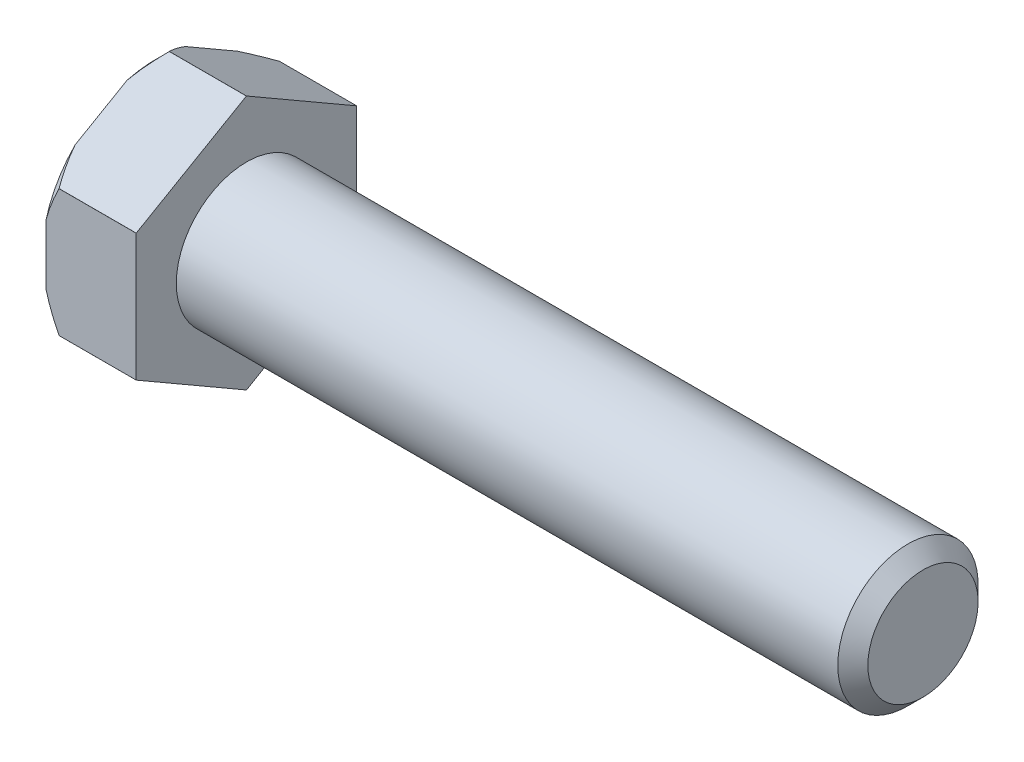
ISO-10303-21;
HEADER;
FILE_DESCRIPTION(('STEP AP214'),'2;1');
FILE_NAME('part.step','',(''),(''),'','','');
FILE_SCHEMA(('AUTOMOTIVE_DESIGN { 1 0 10303 214 1 1 1 1 }'));
ENDSEC;
DATA;
#1=APPLICATION_CONTEXT('core data for automotive mechanical design processes');
#2=APPLICATION_PROTOCOL_DEFINITION('international standard','automotive_design',2000,#1);
#3=PRODUCT_CONTEXT('',#1,'mechanical');
#4=PRODUCT('Part','Part','',(#3));
#5=PRODUCT_RELATED_PRODUCT_CATEGORY('part','',(#4));
#6=PRODUCT_DEFINITION_FORMATION('','',#4);
#7=PRODUCT_DEFINITION_CONTEXT('part definition',#1,'design');
#8=PRODUCT_DEFINITION('design','',#6,#7);
#9=PRODUCT_DEFINITION_SHAPE('','',#8);
#10=(LENGTH_UNIT() NAMED_UNIT(*) SI_UNIT(.MILLI.,.METRE.));
#11=(NAMED_UNIT(*) PLANE_ANGLE_UNIT() SI_UNIT($,.RADIAN.));
#12=(NAMED_UNIT(*) SI_UNIT($,.STERADIAN.) SOLID_ANGLE_UNIT());
#13=UNCERTAINTY_MEASURE_WITH_UNIT(LENGTH_MEASURE(1.E-05),#10,'distance_accuracy_value','');
#14=(GEOMETRIC_REPRESENTATION_CONTEXT(3) GLOBAL_UNCERTAINTY_ASSIGNED_CONTEXT((#13)) GLOBAL_UNIT_ASSIGNED_CONTEXT((#10,
#11,#12)) REPRESENTATION_CONTEXT('',''));
#15=CARTESIAN_POINT('',(0.,0.,0.));
#16=DIRECTION('',(0.,0.,1.));
#17=DIRECTION('',(1.,0.,0.));
#18=AXIS2_PLACEMENT_3D('',#15,#16,#17);
#19=CARTESIAN_POINT('',(-9.,0.,0.));
#20=DIRECTION('',(1.,0.,0.));
#21=DIRECTION('',(0.,0.,-1.));
#22=AXIS2_PLACEMENT_3D('',#19,#20,#21);
#23=PLANE('',#22);
#24=DIRECTION('',(0.,-1.,0.));
#25=VECTOR('',#24,1.);
#26=CARTESIAN_POINT('',(-9.,6.35085296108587,-11.));
#27=LINE('',#26,#25);
#28=CARTESIAN_POINT('',(-9.,2.99332590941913,-11.));
#29=VERTEX_POINT('',#28);
#30=CARTESIAN_POINT('',(-9.,-2.99332590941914,-11.));
#31=VERTEX_POINT('',#30);
#32=EDGE_CURVE('E174',#29,#31,#27,.T.);
#33=ORIENTED_EDGE('',*,*,#32,.T.);
#34=CARTESIAN_POINT('',(-9.,0.,0.));
#35=DIRECTION('',(1.,0.,0.));
#36=DIRECTION('',(0.,0.,-1.));
#37=AXIS2_PLACEMENT_3D('',#34,#35,#36);
#38=CIRCLE('',#37,11.4);
#39=CARTESIAN_POINT('',(-9.,-8.02961648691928,-8.09229627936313));
#40=VERTEX_POINT('',#39);
#41=EDGE_CURVE('E180',#31,#40,#38,.F.);
#42=ORIENTED_EDGE('',*,*,#41,.T.);
#43=DIRECTION('',(0.,-0.5,0.866025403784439));
#44=VECTOR('',#43,1.);
#45=CARTESIAN_POINT('',(-9.,-6.3508529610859,-11.));
#46=LINE('',#45,#44);
#47=CARTESIAN_POINT('',(-9.,-11.0229423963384,-2.90770372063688));
#48=VERTEX_POINT('',#47);
#49=EDGE_CURVE('E163',#40,#48,#46,.T.);
#50=ORIENTED_EDGE('',*,*,#49,.T.);
#51=CARTESIAN_POINT('',(-9.,-11.0229423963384,2.90770372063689));
#52=VERTEX_POINT('',#51);
#53=EDGE_CURVE('E187',#48,#52,#38,.F.);
#54=ORIENTED_EDGE('',*,*,#53,.T.);
#55=DIRECTION('',(0.,0.5,0.866025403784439));
#56=VECTOR('',#55,1.);
#57=CARTESIAN_POINT('',(-9.,-12.7017059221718,0.));
#58=LINE('',#57,#56);
#59=CARTESIAN_POINT('',(-9.,-8.02961648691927,8.09229627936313));
#60=VERTEX_POINT('',#59);
#61=EDGE_CURVE('E173',#52,#60,#58,.T.);
#62=ORIENTED_EDGE('',*,*,#61,.T.);
#63=CARTESIAN_POINT('',(-9.,-2.99332590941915,11.));
#64=VERTEX_POINT('',#63);
#65=EDGE_CURVE('E193',#60,#64,#38,.F.);
#66=ORIENTED_EDGE('',*,*,#65,.T.);
#67=DIRECTION('',(0.,1.,0.));
#68=VECTOR('',#67,1.);
#69=CARTESIAN_POINT('',(-9.,6.35085296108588,11.));
#70=LINE('',#69,#68);
#71=CARTESIAN_POINT('',(-9.,2.99332590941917,11.));
#72=VERTEX_POINT('',#71);
#73=EDGE_CURVE('E263',#64,#72,#70,.T.);
#74=ORIENTED_EDGE('',*,*,#73,.T.);
#75=CARTESIAN_POINT('',(-9.,8.02961648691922,8.09229627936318));
#76=VERTEX_POINT('',#75);
#77=EDGE_CURVE('E200',#72,#76,#38,.F.);
#78=ORIENTED_EDGE('',*,*,#77,.T.);
#79=DIRECTION('',(0.,0.5,-0.866025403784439));
#80=VECTOR('',#79,1.);
#81=CARTESIAN_POINT('',(-9.,12.7017059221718,0.));
#82=LINE('',#81,#80);
#83=CARTESIAN_POINT('',(-9.,11.0229423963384,2.90770372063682));
#84=VERTEX_POINT('',#83);
#85=EDGE_CURVE('E260',#76,#84,#82,.T.);
#86=ORIENTED_EDGE('',*,*,#85,.T.);
#87=CARTESIAN_POINT('',(-9.,11.0229423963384,-2.90770372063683));
#88=VERTEX_POINT('',#87);
#89=EDGE_CURVE('E195',#84,#88,#38,.F.);
#90=ORIENTED_EDGE('',*,*,#89,.T.);
#91=DIRECTION('',(0.,-0.5,-0.866025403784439));
#92=VECTOR('',#91,1.);
#93=CARTESIAN_POINT('',(-9.,6.35085296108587,-11.));
#94=LINE('',#93,#92);
#95=CARTESIAN_POINT('',(-9.,8.02961648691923,-8.09229627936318));
#96=VERTEX_POINT('',#95);
#97=EDGE_CURVE('E258',#88,#96,#94,.T.);
#98=ORIENTED_EDGE('',*,*,#97,.T.);
#99=EDGE_CURVE('E189',#96,#29,#38,.F.);
#100=ORIENTED_EDGE('',*,*,#99,.T.);
#101=EDGE_LOOP('',(#33,#42,#50,#54,#62,#66,#74,#78,#86,#90,#98,#100));
#102=FACE_BOUND('',#101,.T.);
#103=ADVANCED_FACE('F36',(#102),#23,.F.);
#104=CARTESIAN_POINT('',(-49.2334801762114,0.,0.));
#105=DIRECTION('',(-1.,0.,0.));
#106=DIRECTION('',(0.,0.,1.));
#107=AXIS2_PLACEMENT_3D('',#104,#105,#106);
#108=CYLINDRICAL_SURFACE('',#107,12.7);
#109=DIRECTION('',(-1.,0.,0.));
#110=VECTOR('',#109,1.);
#111=CARTESIAN_POINT('',(-49.2334801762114,-6.34744042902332,-11.));
#112=LINE('',#111,#110);
#113=CARTESIAN_POINT('',(0.,-6.34744042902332,-11.));
#114=VERTEX_POINT('',#113);
#115=CARTESIAN_POINT('',(-7.7,-6.34744042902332,-11.));
#116=VERTEX_POINT('',#115);
#117=EDGE_CURVE('E55',#114,#116,#112,.T.);
#118=ORIENTED_EDGE('',*,*,#117,.F.);
#119=CARTESIAN_POINT('',(0.,0.,0.));
#120=DIRECTION('',(-1.,0.,0.));
#121=DIRECTION('',(0.,0.,1.));
#122=AXIS2_PLACEMENT_3D('',#119,#120,#121);
#123=CIRCLE('',#122,12.7);
#124=CARTESIAN_POINT('',(0.,-6.35255922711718,-10.9970446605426));
#125=VERTEX_POINT('',#124);
#126=EDGE_CURVE('E219',#114,#125,#123,.T.);
#127=ORIENTED_EDGE('',*,*,#126,.T.);
#128=DIRECTION('',(-1.,0.,0.));
#129=VECTOR('',#128,1.);
#130=CARTESIAN_POINT('',(-49.2334801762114,-6.35255922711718,-10.9970446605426));
#131=LINE('',#130,#129);
#132=CARTESIAN_POINT('',(-7.7,-6.35255922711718,-10.9970446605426));
#133=VERTEX_POINT('',#132);
#134=EDGE_CURVE('E253',#133,#125,#131,.F.);
#135=ORIENTED_EDGE('',*,*,#134,.F.);
#136=CARTESIAN_POINT('',(-7.7,0.,0.));
#137=DIRECTION('',(1.,0.,0.));
#138=DIRECTION('',(0.,0.,-1.));
#139=AXIS2_PLACEMENT_3D('',#136,#137,#138);
#140=CIRCLE('',#139,12.7);
#141=EDGE_CURVE('E182',#133,#116,#140,.T.);
#142=ORIENTED_EDGE('',*,*,#141,.T.);
#143=EDGE_LOOP('',(#118,#127,#135,#142));
#144=FACE_BOUND('',#143,.T.);
#145=ADVANCED_FACE('F380',(#144),#108,.T.);
#146=DIRECTION('',(-1.,0.,0.));
#147=VECTOR('',#146,1.);
#148=CARTESIAN_POINT('',(-49.2334801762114,6.34744042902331,-11.));
#149=LINE('',#148,#147);
#150=CARTESIAN_POINT('',(-7.7,6.34744042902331,-11.));
#151=VERTEX_POINT('',#150);
#152=CARTESIAN_POINT('',(0.,6.34744042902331,-11.));
#153=VERTEX_POINT('',#152);
#154=EDGE_CURVE('E221',#151,#153,#149,.F.);
#155=ORIENTED_EDGE('',*,*,#154,.F.);
#156=CARTESIAN_POINT('',(-7.7,6.35255922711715,-10.9970446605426));
#157=VERTEX_POINT('',#156);
#158=EDGE_CURVE('E192',#151,#157,#140,.T.);
#159=ORIENTED_EDGE('',*,*,#158,.T.);
#160=DIRECTION('',(-1.,0.,0.));
#161=VECTOR('',#160,1.);
#162=CARTESIAN_POINT('',(-49.2334801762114,6.35255922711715,-10.9970446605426));
#163=LINE('',#162,#161);
#164=CARTESIAN_POINT('',(0.,6.35255922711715,-10.9970446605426));
#165=VERTEX_POINT('',#164);
#166=EDGE_CURVE('E233',#165,#157,#163,.T.);
#167=ORIENTED_EDGE('',*,*,#166,.F.);
#168=EDGE_CURVE('E209',#165,#153,#123,.T.);
#169=ORIENTED_EDGE('',*,*,#168,.T.);
#170=EDGE_LOOP('',(#155,#159,#167,#169));
#171=FACE_BOUND('',#170,.T.);
#172=ADVANCED_FACE('F379',(#171),#108,.T.);
#173=DIRECTION('',(-1.,0.,0.));
#174=VECTOR('',#173,1.);
#175=CARTESIAN_POINT('',(-49.2334801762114,12.6999996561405,-0.00295533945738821));
#176=LINE('',#175,#174);
#177=CARTESIAN_POINT('',(-7.7,12.6999996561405,-0.00295533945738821));
#178=VERTEX_POINT('',#177);
#179=CARTESIAN_POINT('',(0.,12.7,-0.00295474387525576));
#180=VERTEX_POINT('',#179);
#181=EDGE_CURVE('E229',#178,#180,#176,.F.);
#182=ORIENTED_EDGE('',*,*,#181,.F.);
#183=CARTESIAN_POINT('',(-7.7,12.6999996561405,0.00295533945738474));
#184=VERTEX_POINT('',#183);
#185=EDGE_CURVE('E344',#178,#184,#140,.T.);
#186=ORIENTED_EDGE('',*,*,#185,.T.);
#187=DIRECTION('',(-1.,0.,0.));
#188=VECTOR('',#187,1.);
#189=CARTESIAN_POINT('',(-49.2334801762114,12.6999996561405,0.00295533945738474));
#190=LINE('',#189,#188);
#191=CARTESIAN_POINT('',(0.,12.6999996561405,0.00295533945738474));
#192=VERTEX_POINT('',#191);
#193=EDGE_CURVE('E239',#192,#184,#190,.T.);
#194=ORIENTED_EDGE('',*,*,#193,.F.);
#195=EDGE_CURVE('E202',#192,#180,#123,.T.);
#196=ORIENTED_EDGE('',*,*,#195,.T.);
#197=EDGE_LOOP('',(#182,#186,#194,#196));
#198=FACE_BOUND('',#197,.T.);
#199=ADVANCED_FACE('F373',(#198),#108,.T.);
#200=DIRECTION('',(-1.,0.,0.));
#201=VECTOR('',#200,1.);
#202=CARTESIAN_POINT('',(-49.2334801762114,6.35255922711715,10.9970446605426));
#203=LINE('',#202,#201);
#204=CARTESIAN_POINT('',(-7.7,6.35255922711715,10.9970446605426));
#205=VERTEX_POINT('',#204);
#206=CARTESIAN_POINT('',(0.,6.35255922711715,10.9970446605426));
#207=VERTEX_POINT('',#206);
#208=EDGE_CURVE('E235',#205,#207,#203,.F.);
#209=ORIENTED_EDGE('',*,*,#208,.F.);
#210=CARTESIAN_POINT('',(-7.7,6.34744042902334,11.));
#211=VERTEX_POINT('',#210);
#212=EDGE_CURVE('E290',#205,#211,#140,.T.);
#213=ORIENTED_EDGE('',*,*,#212,.T.);
#214=DIRECTION('',(-1.,0.,0.));
#215=VECTOR('',#214,1.);
#216=CARTESIAN_POINT('',(-49.2334801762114,6.34744042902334,11.));
#217=LINE('',#216,#215);
#218=CARTESIAN_POINT('',(0.,6.34744042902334,11.));
#219=VERTEX_POINT('',#218);
#220=EDGE_CURVE('E245',#219,#211,#217,.T.);
#221=ORIENTED_EDGE('',*,*,#220,.F.);
#222=EDGE_CURVE('E196',#219,#207,#123,.T.);
#223=ORIENTED_EDGE('',*,*,#222,.T.);
#224=EDGE_LOOP('',(#209,#213,#221,#223));
#225=FACE_BOUND('',#224,.T.);
#226=ADVANCED_FACE('F370',(#225),#108,.T.);
#227=DIRECTION('',(-1.,0.,0.));
#228=VECTOR('',#227,1.);
#229=CARTESIAN_POINT('',(-49.2334801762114,-6.34744042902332,11.));
#230=LINE('',#229,#228);
#231=CARTESIAN_POINT('',(-7.7,-6.34744042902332,11.));
#232=VERTEX_POINT('',#231);
#233=CARTESIAN_POINT('',(0.,-6.34744042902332,11.));
#234=VERTEX_POINT('',#233);
#235=EDGE_CURVE('E241',#232,#234,#230,.F.);
#236=ORIENTED_EDGE('',*,*,#235,.F.);
#237=CARTESIAN_POINT('',(-7.7,-6.35255922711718,10.9970446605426));
#238=VERTEX_POINT('',#237);
#239=EDGE_CURVE('E354',#232,#238,#140,.T.);
#240=ORIENTED_EDGE('',*,*,#239,.T.);
#241=DIRECTION('',(-1.,0.,0.));
#242=VECTOR('',#241,1.);
#243=CARTESIAN_POINT('',(-49.2334801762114,-6.35255922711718,10.9970446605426));
#244=LINE('',#243,#242);
#245=CARTESIAN_POINT('',(0.,-6.35255922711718,10.9970446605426));
#246=VERTEX_POINT('',#245);
#247=EDGE_CURVE('E251',#246,#238,#244,.T.);
#248=ORIENTED_EDGE('',*,*,#247,.F.);
#249=EDGE_CURVE('E203',#246,#234,#123,.T.);
#250=ORIENTED_EDGE('',*,*,#249,.T.);
#251=EDGE_LOOP('',(#236,#240,#248,#250));
#252=FACE_BOUND('',#251,.T.);
#253=ADVANCED_FACE('F372',(#252),#108,.T.);
#254=DIRECTION('',(-1.,0.,0.));
#255=VECTOR('',#254,1.);
#256=CARTESIAN_POINT('',(-49.2334801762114,-12.6999996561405,0.00295533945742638));
#257=LINE('',#256,#255);
#258=CARTESIAN_POINT('',(-7.7,-12.6999996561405,0.00295533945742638));
#259=VERTEX_POINT('',#258);
#260=CARTESIAN_POINT('',(0.,-12.7,0.00295474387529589));
#261=VERTEX_POINT('',#260);
#262=EDGE_CURVE('E247',#259,#261,#257,.F.);
#263=ORIENTED_EDGE('',*,*,#262,.F.);
#264=CARTESIAN_POINT('',(-7.7,-12.6999996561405,-0.0029553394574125));
#265=VERTEX_POINT('',#264);
#266=EDGE_CURVE('E190',#259,#265,#140,.T.);
#267=ORIENTED_EDGE('',*,*,#266,.T.);
#268=DIRECTION('',(-1.,0.,0.));
#269=VECTOR('',#268,1.);
#270=CARTESIAN_POINT('',(-49.2334801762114,-12.6999996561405,-0.00295533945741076));
#271=LINE('',#270,#269);
#272=CARTESIAN_POINT('',(0.,-12.6999996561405,-0.00295533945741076));
#273=VERTEX_POINT('',#272);
#274=EDGE_CURVE('E63',#273,#265,#271,.T.);
#275=ORIENTED_EDGE('',*,*,#274,.F.);
#276=EDGE_CURVE('E212',#273,#261,#123,.T.);
#277=ORIENTED_EDGE('',*,*,#276,.T.);
#278=EDGE_LOOP('',(#263,#267,#275,#277));
#279=FACE_BOUND('',#278,.T.);
#280=ADVANCED_FACE('F359',(#279),#108,.T.);
#281=CARTESIAN_POINT('',(0.,12.7,0.));
#282=DIRECTION('',(-1.,0.,0.));
#283=DIRECTION('',(0.,0.,1.));
#284=AXIS2_PLACEMENT_3D('',#281,#282,#283);
#285=PLANE('',#284);
#286=CARTESIAN_POINT('',(0.,0.,0.));
#287=DIRECTION('',(-1.,0.,0.));
#288=DIRECTION('',(0.,0.,1.));
#289=AXIS2_PLACEMENT_3D('',#286,#287,#288);
#290=CIRCLE('',#289,7.);
#291=CARTESIAN_POINT('',(0.,0.,7.));
#292=VERTEX_POINT('',#291);
#293=EDGE_CURVE('E213',#292,#292,#290,.T.);
#294=ORIENTED_EDGE('',*,*,#293,.T.);
#295=EDGE_LOOP('',(#294));
#296=FACE_BOUND('',#295,.T.);
#297=DIRECTION('',(0.,-1.,0.));
#298=VECTOR('',#297,1.);
#299=CARTESIAN_POINT('',(0.,12.7,-11.));
#300=LINE('',#299,#298);
#301=EDGE_CURVE('E224',#153,#114,#300,.T.);
#302=ORIENTED_EDGE('',*,*,#301,.F.);
#303=ORIENTED_EDGE('',*,*,#168,.F.);
#304=DIRECTION('',(0.,-0.5,-0.866025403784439));
#305=VECTOR('',#304,1.);
#306=CARTESIAN_POINT('',(0.,12.7012794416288,-0.000738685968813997));
#307=LINE('',#306,#305);
#308=EDGE_CURVE('E231',#180,#165,#307,.T.);
#309=ORIENTED_EDGE('',*,*,#308,.F.);
#310=ORIENTED_EDGE('',*,*,#195,.F.);
#311=DIRECTION('',(0.,0.5,-0.866025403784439));
#312=VECTOR('',#311,1.);
#313=CARTESIAN_POINT('',(0.,12.7012794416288,0.00073868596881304));
#314=LINE('',#313,#312);
#315=EDGE_CURVE('E237',#207,#192,#314,.T.);
#316=ORIENTED_EDGE('',*,*,#315,.F.);
#317=ORIENTED_EDGE('',*,*,#222,.F.);
#318=DIRECTION('',(0.,1.,0.));
#319=VECTOR('',#318,1.);
#320=CARTESIAN_POINT('',(0.,12.7,11.));
#321=LINE('',#320,#319);
#322=EDGE_CURVE('E243',#234,#219,#321,.T.);
#323=ORIENTED_EDGE('',*,*,#322,.F.);
#324=ORIENTED_EDGE('',*,*,#249,.F.);
#325=DIRECTION('',(0.,0.5,0.866025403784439));
#326=VECTOR('',#325,1.);
#327=CARTESIAN_POINT('',(0.,-6.35127944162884,10.9992613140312));
#328=LINE('',#327,#326);
#329=EDGE_CURVE('E249',#261,#246,#328,.T.);
#330=ORIENTED_EDGE('',*,*,#329,.F.);
#331=ORIENTED_EDGE('',*,*,#276,.F.);
#332=DIRECTION('',(0.,-0.5,0.866025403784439));
#333=VECTOR('',#332,1.);
#334=CARTESIAN_POINT('',(0.,-6.35127944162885,-10.9992613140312));
#335=LINE('',#334,#333);
#336=EDGE_CURVE('E255',#125,#273,#335,.T.);
#337=ORIENTED_EDGE('',*,*,#336,.F.);
#338=ORIENTED_EDGE('',*,*,#126,.F.);
#339=EDGE_LOOP('',(#302,#303,#309,#310,#316,#317,#323,#324,#330,#331,#337,#338));
#340=FACE_BOUND('',#339,.T.);
#341=ADVANCED_FACE('F366',(#296,#340),#285,.F.);
#342=CARTESIAN_POINT('',(-9.,0.,0.));
#343=DIRECTION('',(1.,0.,0.));
#344=DIRECTION('',(0.,0.,-1.));
#345=AXIS2_PLACEMENT_3D('',#342,#343,#344);
#346=CONICAL_SURFACE('',#345,11.4,0.785398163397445);
#347=ORIENTED_EDGE('',*,*,#158,.F.);
#348=CARTESIAN_POINT('',(-2.5861565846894,14.0118884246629,-11.));
#349=CARTESIAN_POINT('',(-2.83350289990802,13.6973716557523,-11.));
#350=CARTESIAN_POINT('',(-3.07894908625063,13.3813410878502,-11.));
#351=CARTESIAN_POINT('',(-3.56522410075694,12.7456661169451,-11.));
#352=CARTESIAN_POINT('',(-3.80605214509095,12.4260211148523,-11.));
#353=CARTESIAN_POINT('',(-4.2834040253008,11.7809960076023,-11.));
#354=CARTESIAN_POINT('',(-4.51989964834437,11.455594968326,-11.));
#355=CARTESIAN_POINT('',(-4.98614192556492,10.8000073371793,-11.));
#356=CARTESIAN_POINT('',(-5.21588892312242,10.4698209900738,-11.));
#357=CARTESIAN_POINT('',(-5.67839505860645,9.78732594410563,-11.));
#358=CARTESIAN_POINT('',(-5.91073666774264,9.43473321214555,-11.));
#359=CARTESIAN_POINT('',(-6.36421024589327,8.72232198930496,-11.));
#360=CARTESIAN_POINT('',(-6.58534095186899,8.36250269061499,-11.));
#361=CARTESIAN_POINT('',(-7.0130498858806,7.63523281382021,-11.));
#362=CARTESIAN_POINT('',(-7.21965622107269,7.26779886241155,-11.));
#363=CARTESIAN_POINT('',(-7.61498771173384,6.52349243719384,-11.));
#364=CARTESIAN_POINT('',(-7.80371837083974,6.14662291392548,-11.));
#365=CARTESIAN_POINT('',(-8.14002055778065,5.4220837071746,-11.));
#366=CARTESIAN_POINT('',(-8.28983162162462,5.07546127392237,-11.));
#367=CARTESIAN_POINT('',(-8.56696209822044,4.37319614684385,-11.));
#368=CARTESIAN_POINT('',(-8.69427934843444,4.01755258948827,-11.));
#369=CARTESIAN_POINT('',(-8.92014732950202,3.30165696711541,-11.));
#370=CARTESIAN_POINT('',(-9.01901428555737,2.94150604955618,-11.));
#371=CARTESIAN_POINT('',(-9.18500999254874,2.21389101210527,-11.));
#372=CARTESIAN_POINT('',(-9.25214287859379,1.84642785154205,-11.));
#373=CARTESIAN_POINT('',(-9.35145688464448,1.0997939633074,-11.));
#374=CARTESIAN_POINT('',(-9.3829695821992,0.720532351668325,-11.));
#375=CARTESIAN_POINT('',(-9.40648280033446,-0.039205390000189,-11.));
#376=CARTESIAN_POINT('',(-9.39848664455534,-0.419681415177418,-11.));
#377=CARTESIAN_POINT('',(-9.34350810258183,-1.17894225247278,-11.));
#378=CARTESIAN_POINT('',(-9.29640439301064,-1.55771810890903,-11.));
#379=CARTESIAN_POINT('',(-9.16636771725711,-2.30903116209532,-11.));
#380=CARTESIAN_POINT('',(-9.083425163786,-2.68156666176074,-11.));
#381=CARTESIAN_POINT('',(-8.85567054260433,-3.53401256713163,-11.));
#382=CARTESIAN_POINT('',(-8.69960806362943,-4.01089279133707,-11.));
#383=CARTESIAN_POINT('',(-8.3458695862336,-4.94886907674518,-11.));
#384=CARTESIAN_POINT('',(-8.14816836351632,-5.40995537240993,-11.));
#385=CARTESIAN_POINT('',(-7.71988034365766,-6.32044118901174,-11.));
#386=CARTESIAN_POINT('',(-7.48906729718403,-6.76973283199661,-11.));
#387=CARTESIAN_POINT('',(-7.00366004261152,-7.65498882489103,-11.));
#388=CARTESIAN_POINT('',(-6.74907146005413,-8.09095629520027,-11.));
#389=CARTESIAN_POINT('',(-6.18898743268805,-9.00552230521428,-11.));
#390=CARTESIAN_POINT('',(-5.881104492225,-9.48264861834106,-11.));
#391=CARTESIAN_POINT('',(-5.248400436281,-10.4255978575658,-11.));
#392=CARTESIAN_POINT('',(-4.92357580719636,-10.8914184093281,-11.));
#393=CARTESIAN_POINT('',(-4.43035033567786,-11.5781777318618,-11.));
#394=CARTESIAN_POINT('',(-4.26681713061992,-11.802639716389,-11.));
#395=CARTESIAN_POINT('',(-3.93703802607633,-12.2495672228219,-11.));
#396=CARTESIAN_POINT('',(-3.77079210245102,-12.4720327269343,-11.));
#397=CARTESIAN_POINT('',(-3.43602649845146,-12.9150079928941,-11.));
#398=CARTESIAN_POINT('',(-3.26750842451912,-13.1355189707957,-11.));
#399=CARTESIAN_POINT('',(-2.92835604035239,-13.5748946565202,-11.));
#400=CARTESIAN_POINT('',(-2.75772181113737,-13.7937594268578,-11.));
#401=CARTESIAN_POINT('',(-2.58615658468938,-14.011888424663,-11.));
#402=B_SPLINE_CURVE_WITH_KNOTS('',3,(#348,#349,#350,#351,#352,#353,#354,#355,#356,#357,#358,
#359,#360,#361,#362,#363,#364,#365,#366,#367,#368,#369,#370,#371,#372,#373,#374,#375,#376,#377,
#378,#379,#380,#381,#382,#383,#384,#385,#386,#387,#388,#389,#390,#391,#392,#393,#394,#395,#396,
#397,#398,#399,#400,#401),.UNSPECIFIED.,.F.,.F.,(4,2,2,2,2,2,2,2,2,2,2,2,2,2,2,2,2,2,2,2,2,2,2,
2,2,2,4),(0.,1.20039407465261,2.40099011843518,3.6077087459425,4.81436586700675,
6.08097780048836,7.34773211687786,8.61196342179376,9.87580421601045,11.0080050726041,
12.1403147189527,13.2595042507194,14.3785479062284,15.5182591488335,16.6578745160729,
17.8010385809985,18.9445086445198,20.4471673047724,21.9507388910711,23.4651222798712,
24.9791482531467,26.6821789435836,28.3855642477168,29.218697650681,30.0518384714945,
30.8844182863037,31.7169663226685),.UNSPECIFIED.);
#403=EDGE_CURVE('E12',#151,#29,#402,.T.);
#404=ORIENTED_EDGE('',*,*,#403,.T.);
#405=ORIENTED_EDGE('',*,*,#99,.F.);
#406=CARTESIAN_POINT('',(-1.64013308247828,17.1245129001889,7.66052639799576));
#407=CARTESIAN_POINT('',(-1.88422727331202,16.9738292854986,7.39953472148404));
#408=CARTESIAN_POINT('',(-2.12685298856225,16.8225454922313,7.13750350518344));
#409=CARTESIAN_POINT('',(-2.60860356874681,16.5185690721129,6.61100090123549));
#410=CARTESIAN_POINT('',(-2.84772811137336,16.3658763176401,6.34652929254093));
#411=CARTESIAN_POINT('',(-3.32243871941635,16.0585312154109,5.81419196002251));
#412=CARTESIAN_POINT('',(-3.55801487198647,15.903875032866,5.54631959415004));
#413=CARTESIAN_POINT('',(-4.02426308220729,15.5927291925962,5.0073991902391));
#414=CARTESIAN_POINT('',(-4.25493527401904,15.4362395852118,4.73635123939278));
#415=CARTESIAN_POINT('',(-4.71678387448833,15.11674863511,4.18297668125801));
#416=CARTESIAN_POINT('',(-4.94779495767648,14.9536873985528,3.90054633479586));
#417=CARTESIAN_POINT('',(-5.40232071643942,14.6249754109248,3.33120047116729));
#418=CARTESIAN_POINT('',(-5.62583568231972,14.4593247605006,3.04428512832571));
#419=CARTESIAN_POINT('',(-6.06351114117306,14.1251558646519,2.46548762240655));
#420=CARTESIAN_POINT('',(-6.27767956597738,13.9566402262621,2.17360997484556));
#421=CARTESIAN_POINT('',(-6.69468105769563,13.6161521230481,1.58386728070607));
#422=CARTESIAN_POINT('',(-6.89751558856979,13.4441801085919,1.28600301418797));
#423=CARTESIAN_POINT('',(-7.29309329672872,13.0926912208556,0.677206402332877));
#424=CARTESIAN_POINT('',(-7.48554569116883,12.9130919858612,0.366131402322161));
#425=CARTESIAN_POINT('',(-7.85198696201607,12.5491713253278,-0.264197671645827));
#426=CARTESIAN_POINT('',(-8.02597321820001,12.3648492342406,-0.58345289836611));
#427=CARTESIAN_POINT('',(-8.349725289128,11.992106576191,-1.22906212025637));
#428=CARTESIAN_POINT('',(-8.49961826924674,11.8037139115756,-1.55536778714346));
#429=CARTESIAN_POINT('',(-8.77053720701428,11.4217810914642,-2.21689483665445));
#430=CARTESIAN_POINT('',(-8.89157180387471,11.2282424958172,-2.5521135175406));
#431=CARTESIAN_POINT('',(-9.07848666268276,10.8743812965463,-3.16501909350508));
#432=CARTESIAN_POINT('',(-9.15050671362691,10.7148740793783,-3.44129369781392));
#433=CARTESIAN_POINT('',(-9.26858939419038,10.3934607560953,-3.99799790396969));
#434=CARTESIAN_POINT('',(-9.31465579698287,10.2315550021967,-4.27842689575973));
#435=CARTESIAN_POINT('',(-9.37846278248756,9.90661507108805,-4.84123936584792));
#436=CARTESIAN_POINT('',(-9.39625191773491,9.74358331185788,-5.12361865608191));
#437=CARTESIAN_POINT('',(-9.40267995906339,9.41737132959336,-5.68863438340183));
#438=CARTESIAN_POINT('',(-9.39131850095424,9.25419110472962,-5.97127082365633));
#439=CARTESIAN_POINT('',(-9.3401445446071,8.92941383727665,-6.53380155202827));
#440=CARTESIAN_POINT('',(-9.30040937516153,8.76781369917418,-6.81370120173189));
#441=CARTESIAN_POINT('',(-9.19461003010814,8.44680072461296,-7.36971198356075));
#442=CARTESIAN_POINT('',(-9.12854368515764,8.28738806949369,-7.64582280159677));
#443=CARTESIAN_POINT('',(-8.97278768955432,7.97100015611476,-8.19382274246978));
#444=CARTESIAN_POINT('',(-8.88302746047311,7.814033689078,-8.46569663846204));
#445=CARTESIAN_POINT('',(-8.68327648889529,7.50340029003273,-9.00372946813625));
#446=CARTESIAN_POINT('',(-8.57328674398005,7.34973319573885,-9.26988868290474));
#447=CARTESIAN_POINT('',(-8.29307000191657,6.99034866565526,-9.89236094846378));
#448=CARTESIAN_POINT('',(-8.11549757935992,6.78606847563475,-10.2461846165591));
#449=CARTESIAN_POINT('',(-7.73559772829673,6.38329728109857,-10.943804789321));
#450=CARTESIAN_POINT('',(-7.53325641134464,6.18480960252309,-11.2875955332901));
#451=CARTESIAN_POINT('',(-7.10898448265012,5.79264571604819,-11.9668433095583));
#452=CARTESIAN_POINT('',(-6.88701400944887,5.59898037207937,-12.3022815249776));
#453=CARTESIAN_POINT('',(-6.42813229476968,5.21620661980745,-12.9652651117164));
#454=CARTESIAN_POINT('',(-6.19122381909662,5.02709737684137,-13.2928119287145));
#455=CARTESIAN_POINT('',(-5.70450628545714,4.65187068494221,-13.9427236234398));
#456=CARTESIAN_POINT('',(-5.4546434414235,4.46577076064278,-14.2650581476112));
#457=CARTESIAN_POINT('',(-4.94543059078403,4.09684652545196,-14.9040536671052));
#458=CARTESIAN_POINT('',(-4.6860802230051,3.91402233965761,-15.2207144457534));
#459=CARTESIAN_POINT('',(-4.16001170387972,3.5513427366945,-15.8488939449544));
#460=CARTESIAN_POINT('',(-3.89330151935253,3.37148442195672,-16.160417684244));
#461=CARTESIAN_POINT('',(-3.353663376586,3.01412766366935,-16.7793777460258));
#462=CARTESIAN_POINT('',(-3.08073561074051,2.83662914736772,-17.0868141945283));
#463=CARTESIAN_POINT('',(-2.70910551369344,2.59855156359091,-17.499176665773));
#464=CARTESIAN_POINT('',(-2.61265942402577,2.53708824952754,-17.6056342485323));
#465=CARTESIAN_POINT('',(-2.41917217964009,2.41439026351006,-17.8181533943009));
#466=CARTESIAN_POINT('',(-2.32213099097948,2.35315560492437,-17.9242149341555));
#467=CARTESIAN_POINT('',(-2.12789056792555,2.23115413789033,-18.1355276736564));
#468=CARTESIAN_POINT('',(-2.0306935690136,2.17038643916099,-18.2407804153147));
#469=CARTESIAN_POINT('',(-1.83578934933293,2.04906181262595,-18.4509208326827));
#470=CARTESIAN_POINT('',(-1.73808215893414,1.98850487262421,-18.5558085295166));
#471=CARTESIAN_POINT('',(-1.64013308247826,1.92804598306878,-18.6605263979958));
#472=B_SPLINE_CURVE_WITH_KNOTS('',3,(#406,#407,#408,#409,#410,#411,#412,#413,#414,#415,#416,
#417,#418,#419,#420,#421,#422,#423,#424,#425,#426,#427,#428,#429,#430,#431,#432,#433,#434,#435,
#436,#437,#438,#439,#440,#441,#442,#443,#444,#445,#446,#447,#448,#449,#450,#451,#452,#453,#454,
#455,#456,#457,#458,#459,#460,#461,#462,#463,#464,#465,#466,#467,#468,#469,#470,#471),
.UNSPECIFIED.,.F.,.F.,(4,2,2,2,2,2,2,2,2,2,2,2,2,2,2,2,2,2,2,2,2,2,2,2,2,2,2,2,2,2,2,2,4),(0.,
1.16346736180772,2.32704116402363,3.49341825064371,4.65976338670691,5.85863404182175,
7.05745821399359,8.25524440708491,9.45287552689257,10.6749714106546,11.8972404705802,
13.1128299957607,14.3280551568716,15.3082462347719,16.2882947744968,17.2666587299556,
18.2450349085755,19.2207547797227,20.1965550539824,21.1752954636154,22.1539876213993,
23.4893044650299,24.8253735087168,26.1642209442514,27.5028212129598,28.8475112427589,
30.1922525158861,31.5355912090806,32.8788883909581,33.3476253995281,33.8163893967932,
34.2832530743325,34.7500892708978),.UNSPECIFIED.);
#473=EDGE_CURVE('E292',#96,#157,#472,.T.);
#474=ORIENTED_EDGE('',*,*,#473,.T.);
#475=EDGE_LOOP('',(#347,#404,#405,#474));
#476=FACE_BOUND('',#475,.T.);
#477=ADVANCED_FACE('F312',(#476),#346,.T.);
#478=ORIENTED_EDGE('',*,*,#41,.F.);
#479=EDGE_CURVE('E40',#31,#116,#402,.T.);
#480=ORIENTED_EDGE('',*,*,#479,.T.);
#481=ORIENTED_EDGE('',*,*,#141,.F.);
#482=CARTESIAN_POINT('',(-1.64013308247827,-1.92804598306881,-18.6605263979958));
#483=CARTESIAN_POINT('',(-1.88422727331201,-2.07872959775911,-18.3995347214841));
#484=CARTESIAN_POINT('',(-2.12685298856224,-2.23001339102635,-18.1375035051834));
#485=CARTESIAN_POINT('',(-2.6086035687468,-2.53398981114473,-17.6110009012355));
#486=CARTESIAN_POINT('',(-2.84772811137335,-2.68668256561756,-17.3465292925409));
#487=CARTESIAN_POINT('',(-3.32243871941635,-2.99402766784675,-16.8141919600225));
#488=CARTESIAN_POINT('',(-3.55801487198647,-3.14868385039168,-16.54631959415));
#489=CARTESIAN_POINT('',(-4.02426308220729,-3.45982969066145,-16.0073991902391));
#490=CARTESIAN_POINT('',(-4.25493527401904,-3.61631929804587,-15.7363512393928));
#491=CARTESIAN_POINT('',(-4.71678387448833,-3.93581024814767,-15.182976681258));
#492=CARTESIAN_POINT('',(-4.94779495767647,-4.09887148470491,-14.9005463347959));
#493=CARTESIAN_POINT('',(-5.40232071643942,-4.42758347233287,-14.3312004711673));
#494=CARTESIAN_POINT('',(-5.62583568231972,-4.59323412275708,-14.0442851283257));
#495=CARTESIAN_POINT('',(-6.06351114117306,-4.9274030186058,-13.4654876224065));
#496=CARTESIAN_POINT('',(-6.27767956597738,-5.09591865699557,-13.1736099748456));
#497=CARTESIAN_POINT('',(-6.69468105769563,-5.43640676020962,-12.5838672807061));
#498=CARTESIAN_POINT('',(-6.89751558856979,-5.60837877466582,-12.286003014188));
#499=CARTESIAN_POINT('',(-7.29309329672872,-5.95986766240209,-11.6772064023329));
#500=CARTESIAN_POINT('',(-7.48554569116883,-6.13946689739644,-11.3661314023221));
#501=CARTESIAN_POINT('',(-7.85198696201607,-6.5033875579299,-10.7358023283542));
#502=CARTESIAN_POINT('',(-8.02597321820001,-6.68770964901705,-10.4165471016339));
#503=CARTESIAN_POINT('',(-8.34972528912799,-7.0604523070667,-9.77093787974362));
#504=CARTESIAN_POINT('',(-8.49961826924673,-7.24884497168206,-9.44463221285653));
#505=CARTESIAN_POINT('',(-8.77053720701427,-7.63077779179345,-8.78310516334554));
#506=CARTESIAN_POINT('',(-8.8915718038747,-7.82431638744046,-8.44788648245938));
#507=CARTESIAN_POINT('',(-9.07848666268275,-8.17817758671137,-7.83498090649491));
#508=CARTESIAN_POINT('',(-9.1505067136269,-8.33768480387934,-7.55870630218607));
#509=CARTESIAN_POINT('',(-9.26858939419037,-8.65909812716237,-7.00200209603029));
#510=CARTESIAN_POINT('',(-9.31465579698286,-8.82100388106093,-6.72157310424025));
#511=CARTESIAN_POINT('',(-9.37846278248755,-9.14594381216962,-6.15876063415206));
#512=CARTESIAN_POINT('',(-9.39625191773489,-9.3089755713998,-5.87638134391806));
#513=CARTESIAN_POINT('',(-9.40267995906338,-9.63518755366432,-5.31136561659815));
#514=CARTESIAN_POINT('',(-9.39131850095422,-9.79836777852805,-5.02872917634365));
#515=CARTESIAN_POINT('',(-9.34014454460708,-10.123145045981,-4.46619844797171));
#516=CARTESIAN_POINT('',(-9.3004093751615,-10.2847451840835,-4.18629879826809));
#517=CARTESIAN_POINT('',(-9.19461003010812,-10.6057581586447,-3.63028801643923));
#518=CARTESIAN_POINT('',(-9.12854368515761,-10.765170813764,-3.3541771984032));
#519=CARTESIAN_POINT('',(-8.97278768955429,-11.0815587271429,-2.80617725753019));
#520=CARTESIAN_POINT('',(-8.88302746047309,-11.2385251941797,-2.53430336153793));
#521=CARTESIAN_POINT('',(-8.68327648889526,-11.5491585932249,-1.99627053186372));
#522=CARTESIAN_POINT('',(-8.57328674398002,-11.7028256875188,-1.73011131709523));
#523=CARTESIAN_POINT('',(-8.29307000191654,-12.0622102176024,-1.10763905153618));
#524=CARTESIAN_POINT('',(-8.11549757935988,-12.2664904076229,-0.753815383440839));
#525=CARTESIAN_POINT('',(-7.73559772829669,-12.6692616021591,-0.0561952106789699));
#526=CARTESIAN_POINT('',(-7.5332564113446,-12.8677492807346,0.287595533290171));
#527=CARTESIAN_POINT('',(-7.10898448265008,-13.2599131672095,0.966843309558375));
#528=CARTESIAN_POINT('',(-6.88701400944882,-13.4535785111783,1.30228152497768));
#529=CARTESIAN_POINT('',(-6.42813229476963,-13.8363522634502,1.96526511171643));
#530=CARTESIAN_POINT('',(-6.19122381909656,-14.0254615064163,2.29281192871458));
#531=CARTESIAN_POINT('',(-5.70450628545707,-14.4006881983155,2.94272362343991));
#532=CARTESIAN_POINT('',(-5.45464344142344,-14.5867881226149,3.26505814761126));
#533=CARTESIAN_POINT('',(-4.94543059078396,-14.9557123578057,3.90405366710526));
#534=CARTESIAN_POINT('',(-4.68608022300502,-15.1385365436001,4.22071444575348));
#535=CARTESIAN_POINT('',(-4.16001170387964,-15.5012161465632,4.8488939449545));
#536=CARTESIAN_POINT('',(-3.89330151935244,-15.681074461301,5.16041768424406));
#537=CARTESIAN_POINT('',(-3.3536633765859,-16.0384312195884,5.77937774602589));
#538=CARTESIAN_POINT('',(-3.08073561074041,-16.21592973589,6.08681419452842));
#539=CARTESIAN_POINT('',(-2.70910551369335,-16.4540073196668,6.49917666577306));
#540=CARTESIAN_POINT('',(-2.61265942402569,-16.5154706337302,6.60563424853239));
#541=CARTESIAN_POINT('',(-2.41917217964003,-16.6381686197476,6.81815339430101));
#542=CARTESIAN_POINT('',(-2.32213099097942,-16.6994032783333,6.92421493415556));
#543=CARTESIAN_POINT('',(-2.12789056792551,-16.8214047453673,7.13552767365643));
#544=CARTESIAN_POINT('',(-2.03069356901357,-16.8821724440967,7.24078041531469));
#545=CARTESIAN_POINT('',(-1.83578934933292,-17.0034970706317,7.45092083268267));
#546=CARTESIAN_POINT('',(-1.73808215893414,-17.0640540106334,7.55580852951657));
#547=CARTESIAN_POINT('',(-1.64013308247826,-17.1245129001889,7.66052639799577));
#548=B_SPLINE_CURVE_WITH_KNOTS('',3,(#482,#483,#484,#485,#486,#487,#488,#489,#490,#491,#492,
#493,#494,#495,#496,#497,#498,#499,#500,#501,#502,#503,#504,#505,#506,#507,#508,#509,#510,#511,
#512,#513,#514,#515,#516,#517,#518,#519,#520,#521,#522,#523,#524,#525,#526,#527,#528,#529,#530,
#531,#532,#533,#534,#535,#536,#537,#538,#539,#540,#541,#542,#543,#544,#545,#546,#547),
.UNSPECIFIED.,.F.,.F.,(4,2,2,2,2,2,2,2,2,2,2,2,2,2,2,2,2,2,2,2,2,2,2,2,2,2,2,2,2,2,2,2,4),(0.,
1.16346736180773,2.32704116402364,3.49341825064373,4.65976338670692,5.85863404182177,
7.05745821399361,8.25524440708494,9.4528755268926,10.6749714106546,11.8972404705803,
13.1128299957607,14.3280551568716,15.3082462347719,16.2882947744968,17.2666587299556,
18.2450349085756,19.2207547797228,20.1965550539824,21.1752954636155,22.1539876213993,
23.48930446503,24.8253735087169,26.1642209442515,27.5028212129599,28.847511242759,
30.1922525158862,31.5355912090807,32.8788883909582,33.3476253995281,33.8163893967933,
34.2832530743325,34.7500892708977),.UNSPECIFIED.);
#549=EDGE_CURVE('E166',#133,#40,#548,.T.);
#550=ORIENTED_EDGE('',*,*,#549,.T.);
#551=EDGE_LOOP('',(#478,#480,#481,#550));
#552=FACE_BOUND('',#551,.T.);
#553=ADVANCED_FACE('F179',(#552),#346,.T.);
#554=ORIENTED_EDGE('',*,*,#185,.F.);
#555=EDGE_CURVE('E296',#178,#88,#472,.T.);
#556=ORIENTED_EDGE('',*,*,#555,.T.);
#557=ORIENTED_EDGE('',*,*,#89,.F.);
#558=CARTESIAN_POINT('',(-1.64013308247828,1.92804598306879,18.6605263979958));
#559=CARTESIAN_POINT('',(-1.88422727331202,2.07872959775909,18.399534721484));
#560=CARTESIAN_POINT('',(-2.12685298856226,2.23001339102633,18.1375035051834));
#561=CARTESIAN_POINT('',(-2.60860356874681,2.53398981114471,17.6110009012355));
#562=CARTESIAN_POINT('',(-2.84772811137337,2.68668256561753,17.3465292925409));
#563=CARTESIAN_POINT('',(-3.32243871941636,2.99402766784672,16.8141919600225));
#564=CARTESIAN_POINT('',(-3.55801487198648,3.14868385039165,16.54631959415));
#565=CARTESIAN_POINT('',(-4.02426308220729,3.45982969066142,16.0073991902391));
#566=CARTESIAN_POINT('',(-4.25493527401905,3.61631929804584,15.7363512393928));
#567=CARTESIAN_POINT('',(-4.71678387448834,3.93581024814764,15.182976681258));
#568=CARTESIAN_POINT('',(-4.94779495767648,4.09887148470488,14.9005463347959));
#569=CARTESIAN_POINT('',(-5.40232071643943,4.42758347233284,14.3312004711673));
#570=CARTESIAN_POINT('',(-5.62583568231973,4.59323412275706,14.0442851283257));
#571=CARTESIAN_POINT('',(-6.06351114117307,4.92740301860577,13.4654876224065));
#572=CARTESIAN_POINT('',(-6.27767956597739,5.09591865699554,13.1736099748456));
#573=CARTESIAN_POINT('',(-6.69468105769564,5.43640676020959,12.5838672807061));
#574=CARTESIAN_POINT('',(-6.89751558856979,5.60837877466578,12.286003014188));
#575=CARTESIAN_POINT('',(-7.29309329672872,5.95986766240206,11.6772064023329));
#576=CARTESIAN_POINT('',(-7.48554569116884,6.13946689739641,11.3661314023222));
#577=CARTESIAN_POINT('',(-7.85198696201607,6.50338755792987,10.7358023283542));
#578=CARTESIAN_POINT('',(-8.02597321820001,6.68770964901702,10.4165471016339));
#579=CARTESIAN_POINT('',(-8.349725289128,7.06045230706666,9.77093787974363));
#580=CARTESIAN_POINT('',(-8.49961826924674,7.24884497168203,9.44463221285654));
#581=CARTESIAN_POINT('',(-8.77053720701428,7.63077779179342,8.78310516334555));
#582=CARTESIAN_POINT('',(-8.89157180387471,7.82431638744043,8.44788648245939));
#583=CARTESIAN_POINT('',(-9.07848666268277,8.17817758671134,7.83498090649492));
#584=CARTESIAN_POINT('',(-9.15050671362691,8.33768480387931,7.55870630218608));
#585=CARTESIAN_POINT('',(-9.26858939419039,8.65909812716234,7.00200209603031));
#586=CARTESIAN_POINT('',(-9.31465579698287,8.8210038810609,6.72157310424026));
#587=CARTESIAN_POINT('',(-9.37846278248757,9.14594381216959,6.15876063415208));
#588=CARTESIAN_POINT('',(-9.39625191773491,9.30897557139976,5.87638134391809));
#589=CARTESIAN_POINT('',(-9.4026799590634,9.63518755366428,5.31136561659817));
#590=CARTESIAN_POINT('',(-9.39131850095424,9.79836777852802,5.02872917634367));
#591=CARTESIAN_POINT('',(-9.3401445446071,10.123145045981,4.46619844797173));
#592=CARTESIAN_POINT('',(-9.30040937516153,10.2847451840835,4.18629879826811));
#593=CARTESIAN_POINT('',(-9.19461003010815,10.6057581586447,3.63028801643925));
#594=CARTESIAN_POINT('',(-9.12854368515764,10.765170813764,3.35417719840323));
#595=CARTESIAN_POINT('',(-8.97278768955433,11.0815587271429,2.80617725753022));
#596=CARTESIAN_POINT('',(-8.88302746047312,11.2385251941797,2.53430336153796));
#597=CARTESIAN_POINT('',(-8.68327648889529,11.5491585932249,1.99627053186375));
#598=CARTESIAN_POINT('',(-8.57328674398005,11.7028256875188,1.73011131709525));
#599=CARTESIAN_POINT('',(-8.29307000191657,12.0622102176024,1.10763905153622));
#600=CARTESIAN_POINT('',(-8.11549757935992,12.2664904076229,0.753815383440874));
#601=CARTESIAN_POINT('',(-7.73559772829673,12.6692616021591,0.0561952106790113));
#602=CARTESIAN_POINT('',(-7.53325641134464,12.8677492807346,-0.287595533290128));
#603=CARTESIAN_POINT('',(-7.10898448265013,13.2599131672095,-0.966843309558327));
#604=CARTESIAN_POINT('',(-6.88701400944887,13.4535785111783,-1.30228152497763));
#605=CARTESIAN_POINT('',(-6.42813229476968,13.8363522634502,-1.96526511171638));
#606=CARTESIAN_POINT('',(-6.19122381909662,14.0254615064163,-2.29281192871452));
#607=CARTESIAN_POINT('',(-5.70450628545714,14.4006881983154,-2.94272362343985));
#608=CARTESIAN_POINT('',(-5.45464344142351,14.5867881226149,-3.2650581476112));
#609=CARTESIAN_POINT('',(-4.94543059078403,14.9557123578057,-3.90405366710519));
#610=CARTESIAN_POINT('',(-4.6860802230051,15.1385365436,-4.2207144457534));
#611=CARTESIAN_POINT('',(-4.16001170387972,15.5012161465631,-4.84889394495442));
#612=CARTESIAN_POINT('',(-3.89330151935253,15.6810744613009,-5.16041768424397));
#613=CARTESIAN_POINT('',(-3.353663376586,16.0384312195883,-5.7793777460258));
#614=CARTESIAN_POINT('',(-3.0807356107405,16.2159297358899,-6.08681419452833));
#615=CARTESIAN_POINT('',(-2.70910551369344,16.4540073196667,-6.49917666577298));
#616=CARTESIAN_POINT('',(-2.61265942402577,16.5154706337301,-6.60563424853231));
#617=CARTESIAN_POINT('',(-2.4191721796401,16.6381686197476,-6.81815339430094));
#618=CARTESIAN_POINT('',(-2.32213099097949,16.6994032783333,-6.9242149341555));
#619=CARTESIAN_POINT('',(-2.12789056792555,16.8214047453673,-7.13552767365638));
#620=CARTESIAN_POINT('',(-2.03069356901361,16.8821724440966,-7.24078041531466));
#621=CARTESIAN_POINT('',(-1.83578934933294,17.0034970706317,-7.45092083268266));
#622=CARTESIAN_POINT('',(-1.73808215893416,17.0640540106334,-7.55580852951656));
#623=CARTESIAN_POINT('',(-1.64013308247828,17.1245129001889,-7.66052639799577));
#624=B_SPLINE_CURVE_WITH_KNOTS('',3,(#558,#559,#560,#561,#562,#563,#564,#565,#566,#567,#568,
#569,#570,#571,#572,#573,#574,#575,#576,#577,#578,#579,#580,#581,#582,#583,#584,#585,#586,#587,
#588,#589,#590,#591,#592,#593,#594,#595,#596,#597,#598,#599,#600,#601,#602,#603,#604,#605,#606,
#607,#608,#609,#610,#611,#612,#613,#614,#615,#616,#617,#618,#619,#620,#621,#622,#623),
.UNSPECIFIED.,.F.,.F.,(4,2,2,2,2,2,2,2,2,2,2,2,2,2,2,2,2,2,2,2,2,2,2,2,2,2,2,2,2,2,2,2,4),(0.,
1.16346736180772,2.32704116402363,3.49341825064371,4.65976338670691,5.85863404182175,
7.0574582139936,8.25524440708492,9.45287552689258,10.6749714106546,11.8972404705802,
13.1128299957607,14.3280551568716,15.3082462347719,16.2882947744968,17.2666587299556,
18.2450349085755,19.2207547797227,20.1965550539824,21.1752954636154,22.1539876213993,
23.4893044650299,24.8253735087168,26.1642209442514,27.5028212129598,28.8475112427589,
30.1922525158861,31.5355912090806,32.8788883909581,33.347625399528,33.8163893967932,
34.2832530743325,34.7500892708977),.UNSPECIFIED.);
#625=EDGE_CURVE('E293',#84,#184,#624,.T.);
#626=ORIENTED_EDGE('',*,*,#625,.T.);
#627=EDGE_LOOP('',(#554,#556,#557,#626));
#628=FACE_BOUND('',#627,.T.);
#629=ADVANCED_FACE('F420',(#628),#346,.T.);
#630=ORIENTED_EDGE('',*,*,#212,.F.);
#631=EDGE_CURVE('E289',#205,#76,#624,.T.);
#632=ORIENTED_EDGE('',*,*,#631,.T.);
#633=ORIENTED_EDGE('',*,*,#77,.F.);
#634=CARTESIAN_POINT('',(-2.58615658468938,-14.011888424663,11.));
#635=CARTESIAN_POINT('',(-2.833502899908,-13.6973716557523,11.));
#636=CARTESIAN_POINT('',(-3.07894908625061,-13.3813410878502,11.));
#637=CARTESIAN_POINT('',(-3.56522410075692,-12.7456661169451,11.));
#638=CARTESIAN_POINT('',(-3.80605214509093,-12.4260211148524,11.));
#639=CARTESIAN_POINT('',(-4.28340402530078,-11.7809960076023,11.));
#640=CARTESIAN_POINT('',(-4.51989964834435,-11.4555949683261,11.));
#641=CARTESIAN_POINT('',(-4.9861419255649,-10.8000073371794,11.));
#642=CARTESIAN_POINT('',(-5.2158889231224,-10.4698209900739,11.));
#643=CARTESIAN_POINT('',(-5.67839505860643,-9.78732594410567,11.));
#644=CARTESIAN_POINT('',(-5.91073666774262,-9.43473321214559,11.));
#645=CARTESIAN_POINT('',(-6.36421024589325,-8.722321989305,11.));
#646=CARTESIAN_POINT('',(-6.58534095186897,-8.36250269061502,11.));
#647=CARTESIAN_POINT('',(-7.01304988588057,-7.63523281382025,11.));
#648=CARTESIAN_POINT('',(-7.21965622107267,-7.26779886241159,11.));
#649=CARTESIAN_POINT('',(-7.61498771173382,-6.52349243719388,11.));
#650=CARTESIAN_POINT('',(-7.80371837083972,-6.14662291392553,11.));
#651=CARTESIAN_POINT('',(-8.14002055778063,-5.42208370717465,11.));
#652=CARTESIAN_POINT('',(-8.2898316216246,-5.07546127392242,11.));
#653=CARTESIAN_POINT('',(-8.56696209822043,-4.3731961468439,11.));
#654=CARTESIAN_POINT('',(-8.69427934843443,-4.01755258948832,11.));
#655=CARTESIAN_POINT('',(-8.92014732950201,-3.30165696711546,11.));
#656=CARTESIAN_POINT('',(-9.01901428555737,-2.94150604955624,11.));
#657=CARTESIAN_POINT('',(-9.18500999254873,-2.21389101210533,11.));
#658=CARTESIAN_POINT('',(-9.25214287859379,-1.8464278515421,11.));
#659=CARTESIAN_POINT('',(-9.35145688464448,-1.09979396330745,11.));
#660=CARTESIAN_POINT('',(-9.3829695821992,-0.720532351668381,11.));
#661=CARTESIAN_POINT('',(-9.40648280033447,0.0392053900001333,11.));
#662=CARTESIAN_POINT('',(-9.39848664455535,0.419681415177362,11.));
#663=CARTESIAN_POINT('',(-9.34350810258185,1.17894225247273,11.));
#664=CARTESIAN_POINT('',(-9.29640439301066,1.55771810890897,11.));
#665=CARTESIAN_POINT('',(-9.16636771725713,2.30903116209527,11.));
#666=CARTESIAN_POINT('',(-9.08342516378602,2.68156666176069,11.));
#667=CARTESIAN_POINT('',(-8.85567054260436,3.53401256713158,11.));
#668=CARTESIAN_POINT('',(-8.69960806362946,4.010892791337,11.));
#669=CARTESIAN_POINT('',(-8.34586958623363,4.94886907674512,11.));
#670=CARTESIAN_POINT('',(-8.14816836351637,5.40995537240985,11.));
#671=CARTESIAN_POINT('',(-7.7198803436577,6.32044118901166,11.));
#672=CARTESIAN_POINT('',(-7.48906729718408,6.76973283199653,11.));
#673=CARTESIAN_POINT('',(-7.00366004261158,7.65498882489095,11.));
#674=CARTESIAN_POINT('',(-6.74907146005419,8.09095629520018,11.));
#675=CARTESIAN_POINT('',(-6.18898743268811,9.0055223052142,11.));
#676=CARTESIAN_POINT('',(-5.88110449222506,9.48264861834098,11.));
#677=CARTESIAN_POINT('',(-5.24840043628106,10.4255978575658,11.));
#678=CARTESIAN_POINT('',(-4.92357580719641,10.8914184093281,11.));
#679=CARTESIAN_POINT('',(-4.4303503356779,11.5781777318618,11.));
#680=CARTESIAN_POINT('',(-4.26681713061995,11.8026397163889,11.));
#681=CARTESIAN_POINT('',(-3.93703802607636,12.2495672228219,11.));
#682=CARTESIAN_POINT('',(-3.77079210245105,12.4720327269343,11.));
#683=CARTESIAN_POINT('',(-3.43602649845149,12.915007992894,11.));
#684=CARTESIAN_POINT('',(-3.26750842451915,13.1355189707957,11.));
#685=CARTESIAN_POINT('',(-2.92835604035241,13.5748946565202,11.));
#686=CARTESIAN_POINT('',(-2.75772181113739,13.7937594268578,11.));
#687=CARTESIAN_POINT('',(-2.58615658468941,14.0118884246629,11.));
#688=B_SPLINE_CURVE_WITH_KNOTS('',3,(#634,#635,#636,#637,#638,#639,#640,#641,#642,#643,#644,
#645,#646,#647,#648,#649,#650,#651,#652,#653,#654,#655,#656,#657,#658,#659,#660,#661,#662,#663,
#664,#665,#666,#667,#668,#669,#670,#671,#672,#673,#674,#675,#676,#677,#678,#679,#680,#681,#682,
#683,#684,#685,#686,#687),.UNSPECIFIED.,.F.,.F.,(4,2,2,2,2,2,2,2,2,2,2,2,2,2,2,2,2,2,2,2,2,2,2,
2,2,2,4),(0.,1.20039407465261,2.40099011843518,3.6077087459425,4.81436586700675,
6.08097780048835,7.34773211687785,8.61196342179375,9.87580421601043,11.0080050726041,
12.1403147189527,13.2595042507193,14.3785479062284,15.5182591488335,16.6578745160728,
17.8010385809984,18.9445086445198,20.4471673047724,21.9507388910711,23.4651222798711,
24.9791482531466,26.6821789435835,28.3855642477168,29.2186976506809,30.0518384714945,
30.8844182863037,31.7169663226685),.UNSPECIFIED.);
#689=EDGE_CURVE('E287',#72,#211,#688,.T.);
#690=ORIENTED_EDGE('',*,*,#689,.T.);
#691=EDGE_LOOP('',(#630,#632,#633,#690));
#692=FACE_BOUND('',#691,.T.);
#693=ADVANCED_FACE('F286',(#692),#346,.T.);
#694=ORIENTED_EDGE('',*,*,#239,.F.);
#695=EDGE_CURVE('E278',#232,#64,#688,.T.);
#696=ORIENTED_EDGE('',*,*,#695,.T.);
#697=ORIENTED_EDGE('',*,*,#65,.F.);
#698=CARTESIAN_POINT('',(-1.64013308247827,-17.1245129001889,-7.66052639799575));
#699=CARTESIAN_POINT('',(-1.88422727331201,-16.9738292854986,-7.39953472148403));
#700=CARTESIAN_POINT('',(-2.12685298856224,-16.8225454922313,-7.13750350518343));
#701=CARTESIAN_POINT('',(-2.6086035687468,-16.5185690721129,-6.61100090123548));
#702=CARTESIAN_POINT('',(-2.84772811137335,-16.3658763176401,-6.34652929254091));
#703=CARTESIAN_POINT('',(-3.32243871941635,-16.0585312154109,-5.8141919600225));
#704=CARTESIAN_POINT('',(-3.55801487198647,-15.903875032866,-5.54631959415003));
#705=CARTESIAN_POINT('',(-4.02426308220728,-15.5927291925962,-5.00739919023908));
#706=CARTESIAN_POINT('',(-4.25493527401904,-15.4362395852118,-4.73635123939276));
#707=CARTESIAN_POINT('',(-4.71678387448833,-15.11674863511,-4.18297668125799));
#708=CARTESIAN_POINT('',(-4.94779495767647,-14.9536873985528,-3.90054633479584));
#709=CARTESIAN_POINT('',(-5.40232071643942,-14.6249754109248,-3.33120047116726));
#710=CARTESIAN_POINT('',(-5.62583568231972,-14.4593247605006,-3.04428512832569));
#711=CARTESIAN_POINT('',(-6.06351114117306,-14.1251558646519,-2.46548762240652));
#712=CARTESIAN_POINT('',(-6.27767956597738,-13.9566402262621,-2.17360997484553));
#713=CARTESIAN_POINT('',(-6.69468105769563,-13.6161521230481,-1.58386728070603));
#714=CARTESIAN_POINT('',(-6.89751558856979,-13.4441801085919,-1.28600301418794));
#715=CARTESIAN_POINT('',(-7.29309329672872,-13.0926912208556,-0.677206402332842));
#716=CARTESIAN_POINT('',(-7.48554569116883,-12.9130919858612,-0.366131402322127));
#717=CARTESIAN_POINT('',(-7.85198696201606,-12.5491713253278,0.264197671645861));
#718=CARTESIAN_POINT('',(-8.02597321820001,-12.3648492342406,0.583452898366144));
#719=CARTESIAN_POINT('',(-8.34972528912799,-11.992106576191,1.2290621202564));
#720=CARTESIAN_POINT('',(-8.49961826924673,-11.8037139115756,1.55536778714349));
#721=CARTESIAN_POINT('',(-8.77053720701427,-11.4217810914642,2.21689483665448));
#722=CARTESIAN_POINT('',(-8.8915718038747,-11.2282424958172,2.55211351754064));
#723=CARTESIAN_POINT('',(-9.07848666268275,-10.8743812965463,3.16501909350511));
#724=CARTESIAN_POINT('',(-9.1505067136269,-10.7148740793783,3.44129369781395));
#725=CARTESIAN_POINT('',(-9.26858939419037,-10.3934607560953,3.99799790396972));
#726=CARTESIAN_POINT('',(-9.31465579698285,-10.2315550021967,4.27842689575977));
#727=CARTESIAN_POINT('',(-9.37846278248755,-9.90661507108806,4.84123936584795));
#728=CARTESIAN_POINT('',(-9.39625191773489,-9.74358331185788,5.12361865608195));
#729=CARTESIAN_POINT('',(-9.40267995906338,-9.41737132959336,5.68863438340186));
#730=CARTESIAN_POINT('',(-9.39131850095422,-9.25419110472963,5.97127082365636));
#731=CARTESIAN_POINT('',(-9.34014454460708,-8.92941383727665,6.5338015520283));
#732=CARTESIAN_POINT('',(-9.3004093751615,-8.76781369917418,6.81370120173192));
#733=CARTESIAN_POINT('',(-9.19461003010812,-8.44680072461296,7.36971198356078));
#734=CARTESIAN_POINT('',(-9.12854368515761,-8.28738806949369,7.6458228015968));
#735=CARTESIAN_POINT('',(-8.97278768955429,-7.97100015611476,8.19382274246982));
#736=CARTESIAN_POINT('',(-8.88302746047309,-7.81403368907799,8.46569663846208));
#737=CARTESIAN_POINT('',(-8.68327648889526,-7.50340029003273,9.00372946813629));
#738=CARTESIAN_POINT('',(-8.57328674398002,-7.34973319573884,9.26988868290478));
#739=CARTESIAN_POINT('',(-8.29307000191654,-6.99034866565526,9.89236094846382));
#740=CARTESIAN_POINT('',(-8.11549757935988,-6.78606847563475,10.2461846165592));
#741=CARTESIAN_POINT('',(-7.73559772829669,-6.38329728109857,10.943804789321));
#742=CARTESIAN_POINT('',(-7.5332564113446,-6.18480960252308,11.2875955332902));
#743=CARTESIAN_POINT('',(-7.10898448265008,-5.79264571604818,11.9668433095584));
#744=CARTESIAN_POINT('',(-6.88701400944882,-5.59898037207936,12.3022815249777));
#745=CARTESIAN_POINT('',(-6.42813229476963,-5.21620661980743,12.9652651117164));
#746=CARTESIAN_POINT('',(-6.19122381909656,-5.02709737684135,13.2928119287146));
#747=CARTESIAN_POINT('',(-5.70450628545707,-4.65187068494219,13.9427236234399));
#748=CARTESIAN_POINT('',(-5.45464344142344,-4.46577076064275,14.2650581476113));
#749=CARTESIAN_POINT('',(-4.94543059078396,-4.09684652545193,14.9040536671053));
#750=CARTESIAN_POINT('',(-4.68608022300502,-3.91402233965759,15.2207144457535));
#751=CARTESIAN_POINT('',(-4.16001170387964,-3.55134273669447,15.8488939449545));
#752=CARTESIAN_POINT('',(-3.89330151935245,-3.37148442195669,16.1604176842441));
#753=CARTESIAN_POINT('',(-3.35366337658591,-3.01412766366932,16.7793777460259));
#754=CARTESIAN_POINT('',(-3.08073561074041,-2.83662914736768,17.0868141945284));
#755=CARTESIAN_POINT('',(-2.70910551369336,-2.59855156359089,17.4991766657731));
#756=CARTESIAN_POINT('',(-2.61265942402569,-2.53708824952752,17.6056342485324));
#757=CARTESIAN_POINT('',(-2.41917217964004,-2.41439026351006,17.818153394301));
#758=CARTESIAN_POINT('',(-2.32213099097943,-2.35315560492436,17.9242149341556));
#759=CARTESIAN_POINT('',(-2.12789056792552,-2.23115413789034,18.1355276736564));
#760=CARTESIAN_POINT('',(-2.03069356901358,-2.170386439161,18.2407804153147));
#761=CARTESIAN_POINT('',(-1.83578934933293,-2.04906181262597,18.4509208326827));
#762=CARTESIAN_POINT('',(-1.73808215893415,-1.98850487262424,18.5558085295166));
#763=CARTESIAN_POINT('',(-1.64013308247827,-1.92804598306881,18.6605263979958));
#764=B_SPLINE_CURVE_WITH_KNOTS('',3,(#698,#699,#700,#701,#702,#703,#704,#705,#706,#707,#708,
#709,#710,#711,#712,#713,#714,#715,#716,#717,#718,#719,#720,#721,#722,#723,#724,#725,#726,#727,
#728,#729,#730,#731,#732,#733,#734,#735,#736,#737,#738,#739,#740,#741,#742,#743,#744,#745,#746,
#747,#748,#749,#750,#751,#752,#753,#754,#755,#756,#757,#758,#759,#760,#761,#762,#763),
.UNSPECIFIED.,.F.,.F.,(4,2,2,2,2,2,2,2,2,2,2,2,2,2,2,2,2,2,2,2,2,2,2,2,2,2,2,2,2,2,2,2,4),(0.,
1.16346736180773,2.32704116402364,3.49341825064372,4.65976338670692,5.85863404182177,
7.05745821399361,8.25524440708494,9.45287552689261,10.6749714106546,11.8972404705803,
13.1128299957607,14.3280551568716,15.3082462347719,16.2882947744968,17.2666587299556,
18.2450349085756,19.2207547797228,20.1965550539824,21.1752954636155,22.1539876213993,
23.48930446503,24.8253735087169,26.1642209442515,27.5028212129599,28.847511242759,
30.1922525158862,31.5355912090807,32.8788883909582,33.3476253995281,33.8163893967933,
34.2832530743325,34.7500892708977),.UNSPECIFIED.);
#765=EDGE_CURVE('E183',#60,#238,#764,.T.);
#766=ORIENTED_EDGE('',*,*,#765,.T.);
#767=EDGE_LOOP('',(#694,#696,#697,#766));
#768=FACE_BOUND('',#767,.T.);
#769=ADVANCED_FACE('F276',(#768),#346,.T.);
#770=ORIENTED_EDGE('',*,*,#266,.F.);
#771=EDGE_CURVE('E333',#259,#52,#764,.T.);
#772=ORIENTED_EDGE('',*,*,#771,.T.);
#773=ORIENTED_EDGE('',*,*,#53,.F.);
#774=EDGE_CURVE('E168',#48,#265,#548,.T.);
#775=ORIENTED_EDGE('',*,*,#774,.T.);
#776=EDGE_LOOP('',(#770,#772,#773,#775));
#777=FACE_BOUND('',#776,.T.);
#778=ADVANCED_FACE('F362',(#777),#346,.T.);
#779=CARTESIAN_POINT('',(-49.2334801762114,0.,0.));
#780=DIRECTION('',(-1.,0.,0.));
#781=DIRECTION('',(0.,0.,1.));
#782=AXIS2_PLACEMENT_3D('',#779,#780,#781);
#783=CYLINDRICAL_SURFACE('',#782,7.);
#784=CARTESIAN_POINT('',(66.,0.,0.));
#785=DIRECTION('',(-1.,0.,0.));
#786=DIRECTION('',(0.,0.,1.));
#787=AXIS2_PLACEMENT_3D('',#784,#785,#786);
#788=CIRCLE('',#787,7.);
#789=CARTESIAN_POINT('',(66.,0.,6.99999999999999));
#790=VERTEX_POINT('',#789);
#791=EDGE_CURVE('E341',#790,#790,#788,.T.);
#792=ORIENTED_EDGE('',*,*,#791,.T.);
#793=EDGE_LOOP('',(#792));
#794=FACE_BOUND('',#793,.T.);
#795=ORIENTED_EDGE('',*,*,#293,.F.);
#796=EDGE_LOOP('',(#795));
#797=FACE_BOUND('',#796,.T.);
#798=ADVANCED_FACE('F399',(#794,#797),#783,.T.);
#799=CARTESIAN_POINT('',(67.5,7.,0.));
#800=DIRECTION('',(-1.,0.,0.));
#801=DIRECTION('',(0.,0.,1.));
#802=AXIS2_PLACEMENT_3D('',#799,#800,#801);
#803=PLANE('',#802);
#804=CARTESIAN_POINT('',(67.5,0.,0.));
#805=DIRECTION('',(-1.,0.,0.));
#806=DIRECTION('',(0.,0.,1.));
#807=AXIS2_PLACEMENT_3D('',#804,#805,#806);
#808=CIRCLE('',#807,5.50000000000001);
#809=CARTESIAN_POINT('',(67.5,0.,5.5));
#810=VERTEX_POINT('',#809);
#811=EDGE_CURVE('E338',#810,#810,#808,.F.);
#812=ORIENTED_EDGE('',*,*,#811,.T.);
#813=EDGE_LOOP('',(#812));
#814=FACE_BOUND('',#813,.T.);
#815=ADVANCED_FACE('F402',(#814),#803,.F.);
#816=CARTESIAN_POINT('',(66.,0.,0.));
#817=DIRECTION('',(-1.,0.,0.));
#818=DIRECTION('',(0.,0.,1.));
#819=AXIS2_PLACEMENT_3D('',#816,#817,#818);
#820=CONICAL_SURFACE('',#819,7.,0.78539816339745);
#821=CARTESIAN_POINT('',(67.5,0.,5.5));
#822=CARTESIAN_POINT('',(67.484375,0.,5.515625));
#823=CARTESIAN_POINT('',(67.46875,0.,5.53125));
#824=CARTESIAN_POINT('',(67.4375,0.,5.5625));
#825=CARTESIAN_POINT('',(67.421875,0.,5.578125));
#826=CARTESIAN_POINT('',(67.390625,0.,5.609375));
#827=CARTESIAN_POINT('',(67.375,0.,5.625));
#828=CARTESIAN_POINT('',(67.34375,0.,5.65625));
#829=CARTESIAN_POINT('',(67.328125,0.,5.671875));
#830=CARTESIAN_POINT('',(67.296875,0.,5.703125));
#831=CARTESIAN_POINT('',(67.28125,0.,5.71875));
#832=CARTESIAN_POINT('',(67.25,0.,5.75));
#833=CARTESIAN_POINT('',(67.234375,0.,5.765625));
#834=CARTESIAN_POINT('',(67.203125,0.,5.796875));
#835=CARTESIAN_POINT('',(67.1875,0.,5.8125));
#836=CARTESIAN_POINT('',(67.15625,0.,5.84375));
#837=CARTESIAN_POINT('',(67.140625,0.,5.859375));
#838=CARTESIAN_POINT('',(67.109375,0.,5.890625));
#839=CARTESIAN_POINT('',(67.09375,0.,5.90625));
#840=CARTESIAN_POINT('',(67.0625,0.,5.9375));
#841=CARTESIAN_POINT('',(67.046875,0.,5.953125));
#842=CARTESIAN_POINT('',(67.015625,0.,5.984375));
#843=CARTESIAN_POINT('',(67.,0.,6.));
#844=CARTESIAN_POINT('',(66.96875,0.,6.03125));
#845=CARTESIAN_POINT('',(66.953125,0.,6.046875));
#846=CARTESIAN_POINT('',(66.921875,0.,6.078125));
#847=CARTESIAN_POINT('',(66.90625,0.,6.09375));
#848=CARTESIAN_POINT('',(66.875,0.,6.125));
#849=CARTESIAN_POINT('',(66.859375,0.,6.140625));
#850=CARTESIAN_POINT('',(66.828125,0.,6.171875));
#851=CARTESIAN_POINT('',(66.8125,0.,6.1875));
#852=CARTESIAN_POINT('',(66.78125,0.,6.21875));
#853=CARTESIAN_POINT('',(66.765625,0.,6.234375));
#854=CARTESIAN_POINT('',(66.734375,0.,6.265625));
#855=CARTESIAN_POINT('',(66.71875,0.,6.28125));
#856=CARTESIAN_POINT('',(66.6875,0.,6.3125));
#857=CARTESIAN_POINT('',(66.671875,0.,6.328125));
#858=CARTESIAN_POINT('',(66.640625,0.,6.359375));
#859=CARTESIAN_POINT('',(66.625,0.,6.375));
#860=CARTESIAN_POINT('',(66.59375,0.,6.40625));
#861=CARTESIAN_POINT('',(66.578125,0.,6.421875));
#862=CARTESIAN_POINT('',(66.546875,0.,6.453125));
#863=CARTESIAN_POINT('',(66.53125,0.,6.46875));
#864=CARTESIAN_POINT('',(66.5,0.,6.5));
#865=CARTESIAN_POINT('',(66.484375,0.,6.515625));
#866=CARTESIAN_POINT('',(66.453125,0.,6.546875));
#867=CARTESIAN_POINT('',(66.4375,0.,6.5625));
#868=CARTESIAN_POINT('',(66.40625,0.,6.59375));
#869=CARTESIAN_POINT('',(66.390625,0.,6.609375));
#870=CARTESIAN_POINT('',(66.359375,0.,6.640625));
#871=CARTESIAN_POINT('',(66.34375,0.,6.65624999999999));
#872=CARTESIAN_POINT('',(66.3125,0.,6.68749999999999));
#873=CARTESIAN_POINT('',(66.296875,0.,6.703125));
#874=CARTESIAN_POINT('',(66.265625,0.,6.734375));
#875=CARTESIAN_POINT('',(66.25,0.,6.75));
#876=CARTESIAN_POINT('',(66.21875,0.,6.78124999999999));
#877=CARTESIAN_POINT('',(66.203125,0.,6.79687499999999));
#878=CARTESIAN_POINT('',(66.171875,0.,6.82812499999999));
#879=CARTESIAN_POINT('',(66.15625,0.,6.84374999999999));
#880=CARTESIAN_POINT('',(66.125,0.,6.87499999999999));
#881=CARTESIAN_POINT('',(66.109375,0.,6.89062499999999));
#882=CARTESIAN_POINT('',(66.078125,0.,6.92187499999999));
#883=CARTESIAN_POINT('',(66.0625,0.,6.93749999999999));
#884=CARTESIAN_POINT('',(66.03125,0.,6.96874999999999));
#885=CARTESIAN_POINT('',(66.015625,0.,6.98437499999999));
#886=CARTESIAN_POINT('',(66.,0.,6.99999999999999));
#887=B_SPLINE_CURVE_WITH_KNOTS('',3,(#821,#822,#823,#824,#825,#826,#827,#828,#829,#830,#831,
#832,#833,#834,#835,#836,#837,#838,#839,#840,#841,#842,#843,#844,#845,#846,#847,#848,#849,#850,
#851,#852,#853,#854,#855,#856,#857,#858,#859,#860,#861,#862,#863,#864,#865,#866,#867,#868,#869,
#870,#871,#872,#873,#874,#875,#876,#877,#878,#879,#880,#881,#882,#883,#884,#885,#886),
.UNSPECIFIED.,.F.,.F.,(4,2,2,2,2,2,2,2,2,2,2,2,2,2,2,2,2,2,2,2,2,2,2,2,2,2,2,2,2,2,2,2,4),(0.,
0.0662912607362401,0.13258252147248,0.19887378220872,0.26516504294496,0.3314563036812,
0.39774756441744,0.46403882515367,0.53033008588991,0.596621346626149,0.662912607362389,
0.72920386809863,0.79549512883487,0.8617863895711,0.928077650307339,0.99436891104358,
1.06066017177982,1.12695143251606,1.1932426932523,1.25953395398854,1.32582521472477,
1.39211647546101,1.45840773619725,1.52469899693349,1.59099025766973,1.65728151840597,
1.7235727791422,1.78986403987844,1.85615530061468,1.92244656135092,1.98873782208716,
2.0550290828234,2.12132034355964),.UNSPECIFIED.);
#888=EDGE_CURVE('BSEAM38',#810,#790,#887,.T.);
#889=ORIENTED_EDGE('',*,*,#811,.F.);
#890=ORIENTED_EDGE('',*,*,#791,.F.);
#891=ORIENTED_EDGE('',*,*,#888,.T.);
#892=ORIENTED_EDGE('',*,*,#888,.F.);
#893=EDGE_LOOP('',(#889,#891,#890,#892));
#894=FACE_BOUND('',#893,.T.);
#895=ADVANCED_FACE('F38',(#894),#820,.T.);
#896=CARTESIAN_POINT('',(67.5,-6.3508529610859,-11.));
#897=DIRECTION('',(0.,-0.866025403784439,-0.5));
#898=DIRECTION('',(0.,0.5,-0.866025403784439));
#899=AXIS2_PLACEMENT_3D('',#896,#897,#898);
#900=PLANE('',#899);
#901=ORIENTED_EDGE('',*,*,#134,.T.);
#902=ORIENTED_EDGE('',*,*,#336,.T.);
#903=ORIENTED_EDGE('',*,*,#274,.T.);
#904=ORIENTED_EDGE('',*,*,#774,.F.);
#905=ORIENTED_EDGE('',*,*,#49,.F.);
#906=ORIENTED_EDGE('',*,*,#549,.F.);
#907=EDGE_LOOP('',(#901,#902,#903,#904,#905,#906));
#908=FACE_BOUND('',#907,.T.);
#909=ADVANCED_FACE('F165',(#908),#900,.T.);
#910=CARTESIAN_POINT('',(67.5,-12.7017059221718,0.));
#911=DIRECTION('',(0.,-0.866025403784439,0.5));
#912=DIRECTION('',(0.,-0.5,-0.866025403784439));
#913=AXIS2_PLACEMENT_3D('',#910,#911,#912);
#914=PLANE('',#913);
#915=ORIENTED_EDGE('',*,*,#262,.T.);
#916=ORIENTED_EDGE('',*,*,#329,.T.);
#917=ORIENTED_EDGE('',*,*,#247,.T.);
#918=ORIENTED_EDGE('',*,*,#765,.F.);
#919=ORIENTED_EDGE('',*,*,#61,.F.);
#920=ORIENTED_EDGE('',*,*,#771,.F.);
#921=EDGE_LOOP('',(#915,#916,#917,#918,#919,#920));
#922=FACE_BOUND('',#921,.T.);
#923=ADVANCED_FACE('F324',(#922),#914,.T.);
#924=CARTESIAN_POINT('',(67.5,6.35085296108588,11.));
#925=DIRECTION('',(0.,0.,1.));
#926=DIRECTION('',(0.,-1.,0.));
#927=AXIS2_PLACEMENT_3D('',#924,#925,#926);
#928=PLANE('',#927);
#929=ORIENTED_EDGE('',*,*,#235,.T.);
#930=ORIENTED_EDGE('',*,*,#322,.T.);
#931=ORIENTED_EDGE('',*,*,#220,.T.);
#932=ORIENTED_EDGE('',*,*,#689,.F.);
#933=ORIENTED_EDGE('',*,*,#73,.F.);
#934=ORIENTED_EDGE('',*,*,#695,.F.);
#935=EDGE_LOOP('',(#929,#930,#931,#932,#933,#934));
#936=FACE_BOUND('',#935,.T.);
#937=ADVANCED_FACE('F319',(#936),#928,.T.);
#938=CARTESIAN_POINT('',(67.5,12.7017059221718,0.));
#939=DIRECTION('',(0.,0.866025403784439,0.5));
#940=DIRECTION('',(0.,-0.5,0.866025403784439));
#941=AXIS2_PLACEMENT_3D('',#938,#939,#940);
#942=PLANE('',#941);
#943=ORIENTED_EDGE('',*,*,#208,.T.);
#944=ORIENTED_EDGE('',*,*,#315,.T.);
#945=ORIENTED_EDGE('',*,*,#193,.T.);
#946=ORIENTED_EDGE('',*,*,#625,.F.);
#947=ORIENTED_EDGE('',*,*,#85,.F.);
#948=ORIENTED_EDGE('',*,*,#631,.F.);
#949=EDGE_LOOP('',(#943,#944,#945,#946,#947,#948));
#950=FACE_BOUND('',#949,.T.);
#951=ADVANCED_FACE('F315',(#950),#942,.T.);
#952=CARTESIAN_POINT('',(67.5,6.35085296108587,-11.));
#953=DIRECTION('',(0.,0.866025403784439,-0.5));
#954=DIRECTION('',(0.,0.5,0.866025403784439));
#955=AXIS2_PLACEMENT_3D('',#952,#953,#954);
#956=PLANE('',#955);
#957=ORIENTED_EDGE('',*,*,#181,.T.);
#958=ORIENTED_EDGE('',*,*,#308,.T.);
#959=ORIENTED_EDGE('',*,*,#166,.T.);
#960=ORIENTED_EDGE('',*,*,#473,.F.);
#961=ORIENTED_EDGE('',*,*,#97,.F.);
#962=ORIENTED_EDGE('',*,*,#555,.F.);
#963=EDGE_LOOP('',(#957,#958,#959,#960,#961,#962));
#964=FACE_BOUND('',#963,.T.);
#965=ADVANCED_FACE('F318',(#964),#956,.T.);
#966=CARTESIAN_POINT('',(67.5,6.35085296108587,-11.));
#967=DIRECTION('',(0.,0.,-1.));
#968=DIRECTION('',(0.,1.,0.));
#969=AXIS2_PLACEMENT_3D('',#966,#967,#968);
#970=PLANE('',#969);
#971=ORIENTED_EDGE('',*,*,#154,.T.);
#972=ORIENTED_EDGE('',*,*,#301,.T.);
#973=ORIENTED_EDGE('',*,*,#117,.T.);
#974=ORIENTED_EDGE('',*,*,#479,.F.);
#975=ORIENTED_EDGE('',*,*,#32,.F.);
#976=ORIENTED_EDGE('',*,*,#403,.F.);
#977=EDGE_LOOP('',(#971,#972,#973,#974,#975,#976));
#978=FACE_BOUND('',#977,.T.);
#979=ADVANCED_FACE('F406',(#978),#970,.T.);
#980=CLOSED_SHELL('',(#103,#145,#172,#199,#226,#253,#280,#341,#477,#553,#629,#693,#769,#778,
#798,#815,#895,#909,#923,#937,#951,#965,#979));
#981=MANIFOLD_SOLID_BREP('B2',#980);
#982=ADVANCED_BREP_SHAPE_REPRESENTATION('',(#18,#981),#14);
#983=SHAPE_DEFINITION_REPRESENTATION(#9,#982);
ENDSEC;
END-ISO-10303-21;
